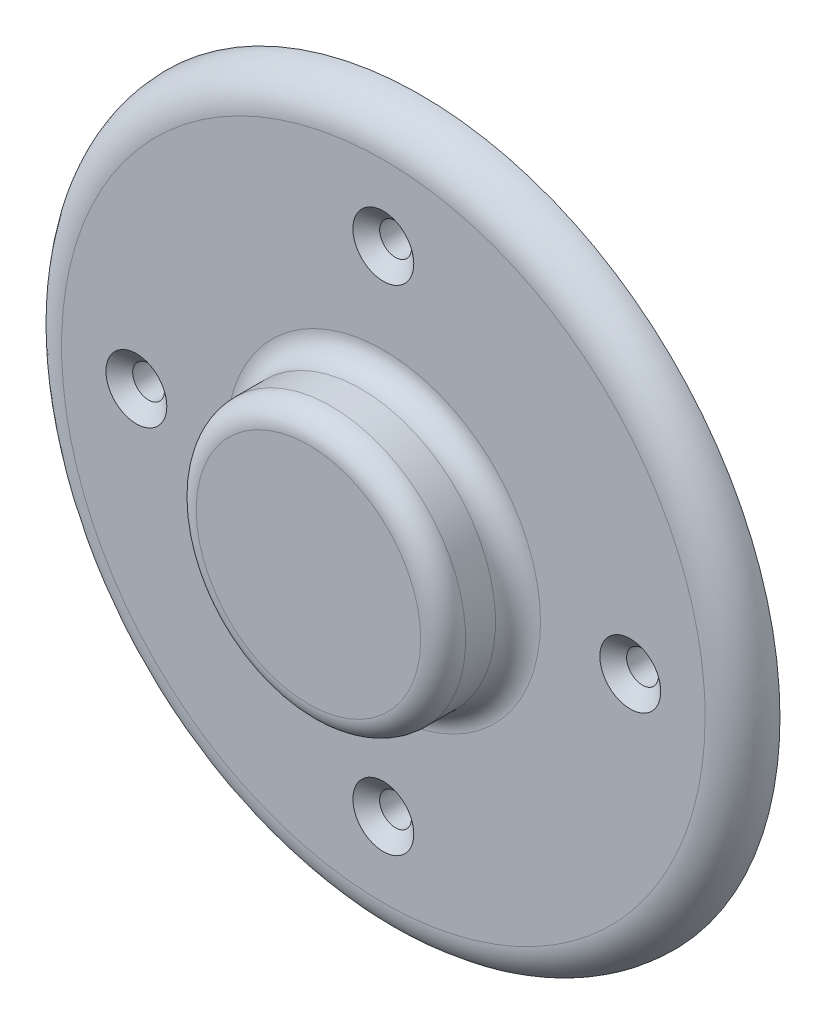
ISO-10303-21;
HEADER;
FILE_DESCRIPTION(('STEP AP214'),'2;1');
FILE_NAME('part.step','',(''),(''),'','','');
FILE_SCHEMA(('AUTOMOTIVE_DESIGN { 1 0 10303 214 1 1 1 1 }'));
ENDSEC;
DATA;
#1=APPLICATION_CONTEXT('core data for automotive mechanical design processes');
#2=APPLICATION_PROTOCOL_DEFINITION('international standard','automotive_design',2000,#1);
#3=PRODUCT_CONTEXT('',#1,'mechanical');
#4=PRODUCT('Part','Part','',(#3));
#5=PRODUCT_RELATED_PRODUCT_CATEGORY('part','',(#4));
#6=PRODUCT_DEFINITION_FORMATION('','',#4);
#7=PRODUCT_DEFINITION_CONTEXT('part definition',#1,'design');
#8=PRODUCT_DEFINITION('design','',#6,#7);
#9=PRODUCT_DEFINITION_SHAPE('','',#8);
#10=(LENGTH_UNIT() NAMED_UNIT(*) SI_UNIT(.MILLI.,.METRE.));
#11=(NAMED_UNIT(*) PLANE_ANGLE_UNIT() SI_UNIT($,.RADIAN.));
#12=(NAMED_UNIT(*) SI_UNIT($,.STERADIAN.) SOLID_ANGLE_UNIT());
#13=UNCERTAINTY_MEASURE_WITH_UNIT(LENGTH_MEASURE(1.E-05),#10,'distance_accuracy_value','');
#14=(GEOMETRIC_REPRESENTATION_CONTEXT(3) GLOBAL_UNCERTAINTY_ASSIGNED_CONTEXT((#13)) GLOBAL_UNIT_ASSIGNED_CONTEXT((#10,
#11,#12)) REPRESENTATION_CONTEXT('',''));
#15=CARTESIAN_POINT('',(0.,0.,0.));
#16=DIRECTION('',(0.,0.,1.));
#17=DIRECTION('',(1.,0.,0.));
#18=AXIS2_PLACEMENT_3D('',#15,#16,#17);
#19=CARTESIAN_POINT('',(136.525,0.,-31.75));
#20=CARTESIAN_POINT('',(136.525,8.93554035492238,-31.75));
#21=CARTESIAN_POINT('',(135.644947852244,17.8708597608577,-31.75));
#22=CARTESIAN_POINT('',(132.158472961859,35.398552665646,-31.75));
#23=CARTESIAN_POINT('',(129.55213642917,43.9904927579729,-31.75));
#24=CARTESIAN_POINT('',(122.713169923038,60.5012184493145,-31.75));
#25=CARTESIAN_POINT('',(118.4807090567,68.4195957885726,-31.75));
#26=CARTESIAN_POINT('',(108.55206858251,83.2788563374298,-31.75));
#27=CARTESIAN_POINT('',(102.856134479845,90.2193721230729,-31.75));
#28=CARTESIAN_POINT('',(90.2193721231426,102.856134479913,-31.75));
#29=CARTESIAN_POINT('',(83.2788563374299,108.552068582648,-31.75));
#30=CARTESIAN_POINT('',(68.4195957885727,118.480709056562,-31.75));
#31=CARTESIAN_POINT('',(60.5012184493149,122.713169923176,-31.75));
#32=CARTESIAN_POINT('',(43.9904927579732,129.552136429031,-31.75));
#33=CARTESIAN_POINT('',(35.3985526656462,132.158472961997,-31.75));
#34=CARTESIAN_POINT('',(17.870859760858,135.644947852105,-31.75));
#35=CARTESIAN_POINT('',(8.93554035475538,136.525,-31.75));
#36=CARTESIAN_POINT('',(-8.93554035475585,136.525,-31.75));
#37=CARTESIAN_POINT('',(-17.8708597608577,135.644947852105,-31.75));
#38=CARTESIAN_POINT('',(-35.3985526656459,132.158472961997,-31.75));
#39=CARTESIAN_POINT('',(-43.9904927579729,129.55213642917,-31.75));
#40=CARTESIAN_POINT('',(-60.5012184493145,122.713169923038,-31.75));
#41=CARTESIAN_POINT('',(-68.4195957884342,118.480709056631,-31.75));
#42=CARTESIAN_POINT('',(-83.2788563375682,108.552068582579,-31.75));
#43=CARTESIAN_POINT('',(-90.2193721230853,102.856134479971,-31.75));
#44=CARTESIAN_POINT('',(-102.856134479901,90.2193721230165,-31.75));
#45=CARTESIAN_POINT('',(-108.552068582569,83.2788563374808,-31.75));
#46=CARTESIAN_POINT('',(-118.480709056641,68.4195957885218,-31.75));
#47=CARTESIAN_POINT('',(-122.713169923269,60.5012184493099,-31.75));
#48=CARTESIAN_POINT('',(-129.552136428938,43.9904927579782,-31.75));
#49=CARTESIAN_POINT('',(-132.158472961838,35.3985526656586,-31.75));
#50=CARTESIAN_POINT('',(-135.644947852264,17.8708597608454,-31.75));
#51=CARTESIAN_POINT('',(-136.525,8.93554035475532,-31.75));
#52=CARTESIAN_POINT('',(-136.525,-8.9355403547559,-31.75));
#53=CARTESIAN_POINT('',(-135.644947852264,-17.8708597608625,-31.75));
#54=CARTESIAN_POINT('',(-132.158472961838,-35.3985526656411,-31.75));
#55=CARTESIAN_POINT('',(-129.552136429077,-43.9904927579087,-31.75));
#56=CARTESIAN_POINT('',(-122.713169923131,-60.5012184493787,-31.75));
#57=CARTESIAN_POINT('',(-118.480709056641,-68.4195957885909,-31.75));
#58=CARTESIAN_POINT('',(-108.552068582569,-83.2788563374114,-31.75));
#59=CARTESIAN_POINT('',(-102.856134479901,-90.2193721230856,-31.75));
#60=CARTESIAN_POINT('',(-90.2193721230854,-102.856134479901,-31.75));
#61=CARTESIAN_POINT('',(-83.2788563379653,-108.552068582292,-31.75));
#62=CARTESIAN_POINT('',(-68.4195957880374,-118.480709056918,-31.75));
#63=CARTESIAN_POINT('',(-60.5012184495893,-122.713169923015,-31.75));
#64=CARTESIAN_POINT('',(-43.9904927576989,-129.552136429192,-31.75));
#65=CARTESIAN_POINT('',(-35.3985526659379,-132.158472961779,-31.75));
#66=CARTESIAN_POINT('',(-17.8708597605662,-135.644947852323,-31.75));
#67=CARTESIAN_POINT('',(-8.93554035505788,-136.525,-31.75));
#68=CARTESIAN_POINT('',(8.93554035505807,-136.525,-31.75));
#69=CARTESIAN_POINT('',(17.870859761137,-135.644947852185,-31.75));
#70=CARTESIAN_POINT('',(35.3985526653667,-132.158472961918,-31.75));
#71=CARTESIAN_POINT('',(43.9904927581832,-129.552136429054,-31.75));
#72=CARTESIAN_POINT('',(60.5012184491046,-122.713169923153,-31.75));
#73=CARTESIAN_POINT('',(68.419595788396,-118.480709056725,-31.75));
#74=CARTESIAN_POINT('',(83.2788563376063,-108.552068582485,-31.75));
#75=CARTESIAN_POINT('',(90.2193721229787,-102.856134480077,-31.75));
#76=CARTESIAN_POINT('',(102.856134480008,-90.2193721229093,-31.75));
#77=CARTESIAN_POINT('',(108.5520685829,-83.2788563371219,-31.75));
#78=CARTESIAN_POINT('',(118.48070905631,-68.4195957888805,-31.75));
#79=CARTESIAN_POINT('',(122.713169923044,-60.5012184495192,-31.75));
#80=CARTESIAN_POINT('',(129.552136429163,-43.9904927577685,-31.75));
#81=CARTESIAN_POINT('',(132.158472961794,-35.3985526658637,-31.75));
#82=CARTESIAN_POINT('',(135.644947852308,-17.8708597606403,-31.75));
#83=CARTESIAN_POINT('',(136.525,-8.93554035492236,-31.75));
#84=CARTESIAN_POINT('',(136.525,0.,-31.75));
#85=CARTESIAN_POINT('',(152.4,0.,-31.75));
#86=CARTESIAN_POINT('',(152.4,9.97455667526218,-31.75));
#87=CARTESIAN_POINT('',(151.417616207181,19.9488667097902,-31.75));
#88=CARTESIAN_POINT('',(147.525737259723,39.5146634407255,-31.75));
#89=CARTESIAN_POINT('',(144.616338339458,49.105666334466,-31.75));
#90=CARTESIAN_POINT('',(136.982143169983,67.5362438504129,-31.75));
#91=CARTESIAN_POINT('',(132.257535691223,76.3753627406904,-31.75));
#92=CARTESIAN_POINT('',(121.174402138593,92.9624442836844,-31.75));
#93=CARTESIAN_POINT('',(114.816150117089,100.709996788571,-31.75));
#94=CARTESIAN_POINT('',(100.709996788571,114.816150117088,-31.75));
#95=CARTESIAN_POINT('',(92.9624442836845,121.174402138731,-31.75));
#96=CARTESIAN_POINT('',(76.3753627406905,132.257535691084,-31.75));
#97=CARTESIAN_POINT('',(67.5362438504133,136.982143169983,-31.75));
#98=CARTESIAN_POINT('',(49.1056663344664,144.616338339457,-31.75));
#99=CARTESIAN_POINT('',(39.5146634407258,147.525737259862,-31.75));
#100=CARTESIAN_POINT('',(19.9488667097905,151.417616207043,-31.75));
#101=CARTESIAN_POINT('',(9.97455667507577,152.4,-31.75));
#102=CARTESIAN_POINT('',(-9.97455667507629,152.4,-31.75));
#103=CARTESIAN_POINT('',(-19.9488667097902,151.417616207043,-31.75));
#104=CARTESIAN_POINT('',(-39.5146634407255,147.525737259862,-31.75));
#105=CARTESIAN_POINT('',(-49.105666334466,144.616338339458,-31.75));
#106=CARTESIAN_POINT('',(-67.5362438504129,136.982143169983,-31.75));
#107=CARTESIAN_POINT('',(-76.3753627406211,132.257535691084,-31.75));
#108=CARTESIAN_POINT('',(-92.9624442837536,121.174402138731,-31.75));
#109=CARTESIAN_POINT('',(-100.709996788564,114.816150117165,-31.75));
#110=CARTESIAN_POINT('',(-114.816150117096,100.709996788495,-31.75));
#111=CARTESIAN_POINT('',(-121.174402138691,92.9624442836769,-31.75));
#112=CARTESIAN_POINT('',(-132.257535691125,76.3753627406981,-31.75));
#113=CARTESIAN_POINT('',(-136.982143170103,67.5362438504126,-31.75));
#114=CARTESIAN_POINT('',(-144.616338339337,49.1056663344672,-31.75));
#115=CARTESIAN_POINT('',(-147.525737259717,39.5146634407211,-31.75));
#116=CARTESIAN_POINT('',(-151.417616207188,19.948866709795,-31.75));
#117=CARTESIAN_POINT('',(-152.4,9.97455667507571,-31.75));
#118=CARTESIAN_POINT('',(-152.4,-9.97455667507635,-31.75));
#119=CARTESIAN_POINT('',(-151.417616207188,-19.9488667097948,-31.75));
#120=CARTESIAN_POINT('',(-147.525737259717,-39.5146634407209,-31.75));
#121=CARTESIAN_POINT('',(-144.616338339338,-49.1056663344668,-31.75));
#122=CARTESIAN_POINT('',(-136.982143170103,-67.5362438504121,-31.75));
#123=CARTESIAN_POINT('',(-132.257535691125,-76.3753627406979,-31.75));
#124=CARTESIAN_POINT('',(-121.174402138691,-92.9624442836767,-31.75));
#125=CARTESIAN_POINT('',(-114.816150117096,-100.709996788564,-31.75));
#126=CARTESIAN_POINT('',(-100.709996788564,-114.816150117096,-31.75));
#127=CARTESIAN_POINT('',(-92.9624442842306,-121.174402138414,-31.75));
#128=CARTESIAN_POINT('',(-76.3753627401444,-132.257535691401,-31.75));
#129=CARTESIAN_POINT('',(-67.5362438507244,-136.982143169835,-31.75));
#130=CARTESIAN_POINT('',(-49.1056663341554,-144.616338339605,-31.75));
#131=CARTESIAN_POINT('',(-39.5146634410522,-147.525737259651,-31.75));
#132=CARTESIAN_POINT('',(-19.9488667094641,-151.417616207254,-31.75));
#133=CARTESIAN_POINT('',(-9.97455667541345,-152.4,-31.75));
#134=CARTESIAN_POINT('',(9.97455667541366,-152.4,-31.75));
#135=CARTESIAN_POINT('',(19.9488667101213,-151.417616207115,-31.75));
#136=CARTESIAN_POINT('',(39.5146634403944,-147.525737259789,-31.75));
#137=CARTESIAN_POINT('',(49.1056663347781,-144.616338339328,-31.75));
#138=CARTESIAN_POINT('',(67.5362438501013,-136.982143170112,-31.75));
#139=CARTESIAN_POINT('',(76.3753627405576,-132.257535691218,-31.75));
#140=CARTESIAN_POINT('',(92.9624442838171,-121.174402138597,-31.75));
#141=CARTESIAN_POINT('',(100.709996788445,-114.816150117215,-31.75));
#142=CARTESIAN_POINT('',(114.816150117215,-100.709996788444,-31.75));
#143=CARTESIAN_POINT('',(121.174402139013,-92.9624442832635,-31.75));
#144=CARTESIAN_POINT('',(132.257535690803,-76.3753627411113,-31.75));
#145=CARTESIAN_POINT('',(136.982143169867,-67.5362438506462,-31.75));
#146=CARTESIAN_POINT('',(144.616338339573,-49.1056663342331,-31.75));
#147=CARTESIAN_POINT('',(147.525737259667,-39.5146634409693,-31.75));
#148=CARTESIAN_POINT('',(151.417616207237,-19.9488667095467,-31.75));
#149=CARTESIAN_POINT('',(152.4,-9.97455667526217,-31.75));
#150=CARTESIAN_POINT('',(152.4,0.,-31.75));
#151=CARTESIAN_POINT('',(152.4,0.,-47.625));
#152=CARTESIAN_POINT('',(152.4,9.97455667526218,-47.625));
#153=CARTESIAN_POINT('',(151.417616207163,19.9488667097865,-47.625));
#154=CARTESIAN_POINT('',(147.525737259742,39.5146634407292,-47.625));
#155=CARTESIAN_POINT('',(144.616338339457,49.1056663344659,-47.625));
#156=CARTESIAN_POINT('',(136.982143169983,67.5362438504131,-47.625));
#157=CARTESIAN_POINT('',(132.257535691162,76.3753627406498,-47.625));
#158=CARTESIAN_POINT('',(121.174402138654,92.962444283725,-47.625));
#159=CARTESIAN_POINT('',(114.816150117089,100.709996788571,-47.625));
#160=CARTESIAN_POINT('',(100.709996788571,114.816150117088,-47.625));
#161=CARTESIAN_POINT('',(92.9624442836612,121.174402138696,-47.625));
#162=CARTESIAN_POINT('',(76.3753627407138,132.257535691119,-47.625));
#163=CARTESIAN_POINT('',(67.5362438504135,136.982143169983,-47.625));
#164=CARTESIAN_POINT('',(49.1056663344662,144.616338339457,-47.625));
#165=CARTESIAN_POINT('',(39.5146634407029,147.525737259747,-47.625));
#166=CARTESIAN_POINT('',(19.9488667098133,151.417616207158,-47.625));
#167=CARTESIAN_POINT('',(9.97455667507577,152.4,-47.625));
#168=CARTESIAN_POINT('',(-9.97455667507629,152.4,-47.625));
#169=CARTESIAN_POINT('',(-19.948866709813,151.417616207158,-47.625));
#170=CARTESIAN_POINT('',(-39.5146634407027,147.525737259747,-47.625));
#171=CARTESIAN_POINT('',(-49.1056663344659,144.616338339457,-47.625));
#172=CARTESIAN_POINT('',(-67.5362438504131,136.982143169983,-47.625));
#173=CARTESIAN_POINT('',(-76.3753627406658,132.257535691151,-47.625));
#174=CARTESIAN_POINT('',(-92.9624442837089,121.174402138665,-47.625));
#175=CARTESIAN_POINT('',(-100.709996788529,114.816150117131,-47.625));
#176=CARTESIAN_POINT('',(-114.81615011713,100.709996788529,-47.625));
#177=CARTESIAN_POINT('',(-121.174402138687,92.9624442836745,-47.625));
#178=CARTESIAN_POINT('',(-132.257535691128,76.3753627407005,-47.625));
#179=CARTESIAN_POINT('',(-136.982143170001,67.5362438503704,-47.625));
#180=CARTESIAN_POINT('',(-144.616338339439,49.1056663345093,-47.625));
#181=CARTESIAN_POINT('',(-147.525737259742,39.5146634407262,-47.625));
#182=CARTESIAN_POINT('',(-151.417616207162,19.9488667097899,-47.625));
#183=CARTESIAN_POINT('',(-152.4,9.97455667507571,-47.625));
#184=CARTESIAN_POINT('',(-152.4,-9.97455667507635,-47.625));
#185=CARTESIAN_POINT('',(-151.417616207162,-19.9488667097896,-47.625));
#186=CARTESIAN_POINT('',(-147.525737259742,-39.514663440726,-47.625));
#187=CARTESIAN_POINT('',(-144.616338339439,-49.1056663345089,-47.625));
#188=CARTESIAN_POINT('',(-136.982143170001,-67.53624385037,-47.625));
#189=CARTESIAN_POINT('',(-132.257535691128,-76.3753627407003,-47.625));
#190=CARTESIAN_POINT('',(-121.174402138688,-92.9624442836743,-47.625));
#191=CARTESIAN_POINT('',(-114.816150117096,-100.709996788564,-47.625));
#192=CARTESIAN_POINT('',(-100.709996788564,-114.816150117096,-47.625));
#193=CARTESIAN_POINT('',(-92.9624442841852,-121.174402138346,-47.625));
#194=CARTESIAN_POINT('',(-76.3753627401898,-132.257535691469,-47.625));
#195=CARTESIAN_POINT('',(-67.5362438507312,-136.982143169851,-47.625));
#196=CARTESIAN_POINT('',(-49.1056663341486,-144.616338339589,-47.625));
#197=CARTESIAN_POINT('',(-39.5146634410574,-147.525737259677,-47.625));
#198=CARTESIAN_POINT('',(-19.9488667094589,-151.417616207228,-47.625));
#199=CARTESIAN_POINT('',(-9.97455667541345,-152.4,-47.625));
#200=CARTESIAN_POINT('',(9.97455667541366,-152.4,-47.625));
#201=CARTESIAN_POINT('',(19.9488667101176,-151.417616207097,-47.625));
#202=CARTESIAN_POINT('',(39.5146634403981,-147.525737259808,-47.625));
#203=CARTESIAN_POINT('',(49.105666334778,-144.616338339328,-47.625));
#204=CARTESIAN_POINT('',(67.5362438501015,-136.982143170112,-47.625));
#205=CARTESIAN_POINT('',(76.37536274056,-132.257535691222,-47.625));
#206=CARTESIAN_POINT('',(92.9624442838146,-121.174402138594,-47.625));
#207=CARTESIAN_POINT('',(100.709996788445,-114.816150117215,-47.625));
#208=CARTESIAN_POINT('',(114.816150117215,-100.709996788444,-47.625));
#209=CARTESIAN_POINT('',(121.174402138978,-92.9624442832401,-47.625));
#210=CARTESIAN_POINT('',(132.257535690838,-76.3753627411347,-47.625));
#211=CARTESIAN_POINT('',(136.982143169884,-67.5362438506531,-47.625));
#212=CARTESIAN_POINT('',(144.616338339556,-49.1056663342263,-47.625));
#213=CARTESIAN_POINT('',(147.525737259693,-39.5146634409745,-47.625));
#214=CARTESIAN_POINT('',(151.417616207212,-19.9488667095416,-47.625));
#215=CARTESIAN_POINT('',(152.4,-9.97455667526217,-47.625));
#216=CARTESIAN_POINT('',(152.4,0.,-47.625));
#217=(BOUNDED_SURFACE() B_SPLINE_SURFACE(2,3,((#19,#20,#21,#22,#23,#24,#25,#26,#27,#28,#29,#30,
#31,#32,#33,#34,#35,#36,#37,#38,#39,#40,#41,#42,#43,#44,#45,#46,#47,#48,#49,#50,#51,#52,#53,#54,
#55,#56,#57,#58,#59,#60,#61,#62,#63,#64,#65,#66,#67,#68,#69,#70,#71,#72,#73,#74,#75,#76,#77,#78,
#79,#80,#81,#82,#83,#84),(#85,#86,#87,#88,#89,#90,#91,#92,#93,#94,#95,#96,#97,#98,#99,#100,#101,
#102,#103,#104,#105,#106,#107,#108,#109,#110,#111,#112,#113,#114,#115,#116,#117,#118,#119,#120,
#121,#122,#123,#124,#125,#126,#127,#128,#129,#130,#131,#132,#133,#134,#135,#136,#137,#138,#139,
#140,#141,#142,#143,#144,#145,#146,#147,#148,#149,#150),(#151,#152,#153,#154,#155,#156,#157,
#158,#159,#160,#161,#162,#163,#164,#165,#166,#167,#168,#169,#170,#171,#172,#173,#174,#175,#176,
#177,#178,#179,#180,#181,#182,#183,#184,#185,#186,#187,#188,#189,#190,#191,#192,#193,#194,#195,
#196,#197,#198,#199,#200,#201,#202,#203,#204,#205,#206,#207,#208,#209,#210,#211,#212,#213,#214,
#215,#216)),.UNSPECIFIED.,.F.,.T.,.F.) B_SPLINE_SURFACE_WITH_KNOTS((3,3),(4,2,2,2,2,2,2,2,2,2,2,
2,2,2,2,2,2,2,2,2,2,2,2,2,2,2,2,2,2,2,2,2,4),(0.,1.),(-6.28318530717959,-6.08683576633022,
-5.89048622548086,-5.6941366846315,-5.49778714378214,-5.30143760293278,-5.10508806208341,
-4.90873852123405,-4.71238898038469,-4.51603943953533,-4.31968989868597,-4.1233403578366,
-3.92699081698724,-3.73064127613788,-3.53429173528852,-3.33794219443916,-3.14159265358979,
-2.94524311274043,-2.74889357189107,-2.55254403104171,-2.35619449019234,-2.15984494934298,
-1.96349540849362,-1.76714586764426,-1.5707963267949,-1.37444678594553,-1.17809724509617,
-0.98174770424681,-0.785398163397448,-0.589048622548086,-0.392699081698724,-0.196349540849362,
0.),.UNSPECIFIED.) GEOMETRIC_REPRESENTATION_ITEM() RATIONAL_B_SPLINE_SURFACE(((1.,1.,1.,1.,1.,
1.,1.,1.,1.,1.,1.,1.,1.,1.,1.,1.,1.,1.,1.,1.,1.,1.,1.,1.,1.,1.,1.,1.,1.,1.,1.,1.,1.,1.,1.,1.,1.,
1.,1.,1.,1.,1.,1.,1.,1.,1.,1.,1.,1.,1.,1.,1.,1.,1.,1.,1.,1.,1.,1.,1.,1.,1.,1.,1.,1.,1.),
(0.707106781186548,0.707106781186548,0.707106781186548,0.707106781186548,0.707106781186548,
0.707106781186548,0.707106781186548,0.707106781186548,0.707106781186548,0.707106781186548,
0.707106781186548,0.707106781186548,0.707106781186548,0.707106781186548,0.707106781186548,
0.707106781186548,0.707106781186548,0.707106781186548,0.707106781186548,0.707106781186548,
0.707106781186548,0.707106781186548,0.707106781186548,0.707106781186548,0.707106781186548,
0.707106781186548,0.707106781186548,0.707106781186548,0.707106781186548,0.707106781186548,
0.707106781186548,0.707106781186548,0.707106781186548,0.707106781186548,0.707106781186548,
0.707106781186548,0.707106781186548,0.707106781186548,0.707106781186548,0.707106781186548,
0.707106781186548,0.707106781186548,0.707106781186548,0.707106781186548,0.707106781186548,
0.707106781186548,0.707106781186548,0.707106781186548,0.707106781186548,0.707106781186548,
0.707106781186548,0.707106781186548,0.707106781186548,0.707106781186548,0.707106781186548,
0.707106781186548,0.707106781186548,0.707106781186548,0.707106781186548,0.707106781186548,
0.707106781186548,0.707106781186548,0.707106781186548,0.707106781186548,0.707106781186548,
0.707106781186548),(1.,1.,1.,1.,1.,1.,1.,1.,1.,1.,1.,1.,1.,1.,1.,1.,1.,1.,1.,1.,1.,1.,1.,1.,1.,
1.,1.,1.,1.,1.,1.,1.,1.,1.,1.,1.,1.,1.,1.,1.,1.,1.,1.,1.,1.,1.,1.,1.,1.,1.,1.,1.,1.,1.,1.,1.,1.,
1.,1.,1.,1.,1.,1.,1.,1.,1.))) REPRESENTATION_ITEM('') SURFACE());
#218=CARTESIAN_POINT('',(136.525,0.,-31.75));
#219=CARTESIAN_POINT('',(136.525,-8.93554035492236,-31.75));
#220=CARTESIAN_POINT('',(135.644947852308,-17.8708597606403,-31.75));
#221=CARTESIAN_POINT('',(132.158472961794,-35.3985526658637,-31.75));
#222=CARTESIAN_POINT('',(129.552136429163,-43.9904927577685,-31.75));
#223=CARTESIAN_POINT('',(122.713169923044,-60.5012184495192,-31.75));
#224=CARTESIAN_POINT('',(118.48070905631,-68.4195957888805,-31.75));
#225=CARTESIAN_POINT('',(108.5520685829,-83.2788563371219,-31.75));
#226=CARTESIAN_POINT('',(102.856134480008,-90.2193721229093,-31.75));
#227=CARTESIAN_POINT('',(90.2193721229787,-102.856134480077,-31.75));
#228=CARTESIAN_POINT('',(83.2788563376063,-108.552068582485,-31.75));
#229=CARTESIAN_POINT('',(68.419595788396,-118.480709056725,-31.75));
#230=CARTESIAN_POINT('',(60.5012184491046,-122.713169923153,-31.75));
#231=CARTESIAN_POINT('',(43.9904927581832,-129.552136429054,-31.75));
#232=CARTESIAN_POINT('',(35.3985526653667,-132.158472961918,-31.75));
#233=CARTESIAN_POINT('',(17.870859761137,-135.644947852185,-31.75));
#234=CARTESIAN_POINT('',(8.93554035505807,-136.525,-31.75));
#235=CARTESIAN_POINT('',(-8.93554035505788,-136.525,-31.75));
#236=CARTESIAN_POINT('',(-17.8708597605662,-135.644947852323,-31.75));
#237=CARTESIAN_POINT('',(-35.3985526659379,-132.158472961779,-31.75));
#238=CARTESIAN_POINT('',(-43.9904927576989,-129.552136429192,-31.75));
#239=CARTESIAN_POINT('',(-60.5012184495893,-122.713169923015,-31.75));
#240=CARTESIAN_POINT('',(-68.4195957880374,-118.480709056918,-31.75));
#241=CARTESIAN_POINT('',(-83.2788563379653,-108.552068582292,-31.75));
#242=CARTESIAN_POINT('',(-90.2193721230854,-102.856134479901,-31.75));
#243=CARTESIAN_POINT('',(-102.856134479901,-90.2193721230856,-31.75));
#244=CARTESIAN_POINT('',(-108.552068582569,-83.2788563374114,-31.75));
#245=CARTESIAN_POINT('',(-118.480709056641,-68.4195957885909,-31.75));
#246=CARTESIAN_POINT('',(-122.713169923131,-60.5012184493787,-31.75));
#247=CARTESIAN_POINT('',(-129.552136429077,-43.9904927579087,-31.75));
#248=CARTESIAN_POINT('',(-132.158472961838,-35.3985526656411,-31.75));
#249=CARTESIAN_POINT('',(-135.644947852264,-17.8708597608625,-31.75));
#250=CARTESIAN_POINT('',(-136.525,-8.9355403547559,-31.75));
#251=CARTESIAN_POINT('',(-136.525,8.93554035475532,-31.75));
#252=CARTESIAN_POINT('',(-135.644947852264,17.8708597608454,-31.75));
#253=CARTESIAN_POINT('',(-132.158472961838,35.3985526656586,-31.75));
#254=CARTESIAN_POINT('',(-129.552136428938,43.9904927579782,-31.75));
#255=CARTESIAN_POINT('',(-122.713169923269,60.5012184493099,-31.75));
#256=CARTESIAN_POINT('',(-118.480709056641,68.4195957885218,-31.75));
#257=CARTESIAN_POINT('',(-108.552068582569,83.2788563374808,-31.75));
#258=CARTESIAN_POINT('',(-102.856134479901,90.2193721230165,-31.75));
#259=CARTESIAN_POINT('',(-90.2193721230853,102.856134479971,-31.75));
#260=CARTESIAN_POINT('',(-83.2788563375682,108.552068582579,-31.75));
#261=CARTESIAN_POINT('',(-68.4195957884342,118.480709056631,-31.75));
#262=CARTESIAN_POINT('',(-60.5012184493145,122.713169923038,-31.75));
#263=CARTESIAN_POINT('',(-43.9904927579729,129.55213642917,-31.75));
#264=CARTESIAN_POINT('',(-35.3985526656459,132.158472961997,-31.75));
#265=CARTESIAN_POINT('',(-17.8708597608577,135.644947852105,-31.75));
#266=CARTESIAN_POINT('',(-8.93554035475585,136.525,-31.75));
#267=CARTESIAN_POINT('',(8.93554035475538,136.525,-31.75));
#268=CARTESIAN_POINT('',(17.870859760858,135.644947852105,-31.75));
#269=CARTESIAN_POINT('',(35.3985526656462,132.158472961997,-31.75));
#270=CARTESIAN_POINT('',(43.9904927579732,129.552136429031,-31.75));
#271=CARTESIAN_POINT('',(60.5012184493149,122.713169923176,-31.75));
#272=CARTESIAN_POINT('',(68.4195957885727,118.480709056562,-31.75));
#273=CARTESIAN_POINT('',(83.2788563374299,108.552068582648,-31.75));
#274=CARTESIAN_POINT('',(90.2193721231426,102.856134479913,-31.75));
#275=CARTESIAN_POINT('',(102.856134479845,90.2193721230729,-31.75));
#276=CARTESIAN_POINT('',(108.55206858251,83.2788563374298,-31.75));
#277=CARTESIAN_POINT('',(118.4807090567,68.4195957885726,-31.75));
#278=CARTESIAN_POINT('',(122.713169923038,60.5012184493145,-31.75));
#279=CARTESIAN_POINT('',(129.55213642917,43.9904927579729,-31.75));
#280=CARTESIAN_POINT('',(132.158472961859,35.398552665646,-31.75));
#281=CARTESIAN_POINT('',(135.644947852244,17.8708597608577,-31.75));
#282=CARTESIAN_POINT('',(136.525,8.93554035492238,-31.75));
#283=CARTESIAN_POINT('',(136.525,0.,-31.75));
#284=(BOUNDED_CURVE() B_SPLINE_CURVE(3,(#218,#219,#220,#221,#222,#223,#224,#225,#226,#227,#228,
#229,#230,#231,#232,#233,#234,#235,#236,#237,#238,#239,#240,#241,#242,#243,#244,#245,#246,#247,
#248,#249,#250,#251,#252,#253,#254,#255,#256,#257,#258,#259,#260,#261,#262,#263,#264,#265,#266,
#267,#268,#269,#270,#271,#272,#273,#274,#275,#276,#277,#278,#279,#280,#281,#282,#283),
.UNSPECIFIED.,.T.,.F.) B_SPLINE_CURVE_WITH_KNOTS((4,2,2,2,2,2,2,2,2,2,2,2,2,2,2,2,2,2,2,2,2,2,2,
2,2,2,2,2,2,2,2,2,4),(-6.28318530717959,-6.08683576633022,-5.89048622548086,-5.6941366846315,
-5.49778714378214,-5.30143760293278,-5.10508806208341,-4.90873852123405,-4.71238898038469,
-4.51603943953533,-4.31968989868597,-4.1233403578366,-3.92699081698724,-3.73064127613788,
-3.53429173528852,-3.33794219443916,-3.14159265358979,-2.94524311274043,-2.74889357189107,
-2.55254403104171,-2.35619449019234,-2.15984494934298,-1.96349540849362,-1.76714586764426,
-1.5707963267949,-1.37444678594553,-1.17809724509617,-0.981747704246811,-0.785398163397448,
-0.589048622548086,-0.392699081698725,-0.196349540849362,0.),
.UNSPECIFIED.) CURVE() GEOMETRIC_REPRESENTATION_ITEM() RATIONAL_B_SPLINE_CURVE((1.,1.,1.,1.,1.,
1.,1.,1.,1.,1.,1.,1.,1.,1.,1.,1.,1.,1.,1.,1.,1.,1.,1.,1.,1.,1.,1.,1.,1.,1.,1.,1.,1.,1.,1.,1.,1.,
1.,1.,1.,1.,1.,1.,1.,1.,1.,1.,1.,1.,1.,1.,1.,1.,1.,1.,1.,1.,1.,1.,1.,1.,1.,1.,1.,1.,1.)) REPRESENTATION_ITEM(''));
#285=CARTESIAN_POINT('',(136.525,0.,-31.75));
#286=VERTEX_POINT('',#285);
#287=EDGE_CURVE('E10',#286,#286,#284,.F.);
#288=CARTESIAN_POINT('',(152.4,0.,-47.625));
#289=CARTESIAN_POINT('',(152.4,9.97455667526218,-47.625));
#290=CARTESIAN_POINT('',(151.417616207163,19.9488667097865,-47.625));
#291=CARTESIAN_POINT('',(147.525737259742,39.5146634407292,-47.625));
#292=CARTESIAN_POINT('',(144.616338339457,49.1056663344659,-47.625));
#293=CARTESIAN_POINT('',(136.982143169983,67.5362438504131,-47.625));
#294=CARTESIAN_POINT('',(132.257535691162,76.3753627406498,-47.625));
#295=CARTESIAN_POINT('',(121.174402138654,92.962444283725,-47.625));
#296=CARTESIAN_POINT('',(114.816150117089,100.709996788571,-47.625));
#297=CARTESIAN_POINT('',(100.709996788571,114.816150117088,-47.625));
#298=CARTESIAN_POINT('',(92.9624442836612,121.174402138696,-47.625));
#299=CARTESIAN_POINT('',(76.3753627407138,132.257535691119,-47.625));
#300=CARTESIAN_POINT('',(67.5362438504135,136.982143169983,-47.625));
#301=CARTESIAN_POINT('',(49.1056663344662,144.616338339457,-47.625));
#302=CARTESIAN_POINT('',(39.5146634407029,147.525737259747,-47.625));
#303=CARTESIAN_POINT('',(19.9488667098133,151.417616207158,-47.625));
#304=CARTESIAN_POINT('',(9.97455667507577,152.4,-47.625));
#305=CARTESIAN_POINT('',(-9.97455667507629,152.4,-47.625));
#306=CARTESIAN_POINT('',(-19.948866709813,151.417616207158,-47.625));
#307=CARTESIAN_POINT('',(-39.5146634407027,147.525737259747,-47.625));
#308=CARTESIAN_POINT('',(-49.1056663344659,144.616338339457,-47.625));
#309=CARTESIAN_POINT('',(-67.5362438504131,136.982143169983,-47.625));
#310=CARTESIAN_POINT('',(-76.3753627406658,132.257535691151,-47.625));
#311=CARTESIAN_POINT('',(-92.9624442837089,121.174402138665,-47.625));
#312=CARTESIAN_POINT('',(-100.709996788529,114.816150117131,-47.625));
#313=CARTESIAN_POINT('',(-114.81615011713,100.709996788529,-47.625));
#314=CARTESIAN_POINT('',(-121.174402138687,92.9624442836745,-47.625));
#315=CARTESIAN_POINT('',(-132.257535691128,76.3753627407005,-47.625));
#316=CARTESIAN_POINT('',(-136.982143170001,67.5362438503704,-47.625));
#317=CARTESIAN_POINT('',(-144.616338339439,49.1056663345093,-47.625));
#318=CARTESIAN_POINT('',(-147.525737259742,39.5146634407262,-47.625));
#319=CARTESIAN_POINT('',(-151.417616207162,19.9488667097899,-47.625));
#320=CARTESIAN_POINT('',(-152.4,9.97455667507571,-47.625));
#321=CARTESIAN_POINT('',(-152.4,-9.97455667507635,-47.625));
#322=CARTESIAN_POINT('',(-151.417616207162,-19.9488667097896,-47.625));
#323=CARTESIAN_POINT('',(-147.525737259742,-39.514663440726,-47.625));
#324=CARTESIAN_POINT('',(-144.616338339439,-49.1056663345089,-47.625));
#325=CARTESIAN_POINT('',(-136.982143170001,-67.53624385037,-47.625));
#326=CARTESIAN_POINT('',(-132.257535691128,-76.3753627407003,-47.625));
#327=CARTESIAN_POINT('',(-121.174402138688,-92.9624442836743,-47.625));
#328=CARTESIAN_POINT('',(-114.816150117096,-100.709996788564,-47.625));
#329=CARTESIAN_POINT('',(-100.709996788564,-114.816150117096,-47.625));
#330=CARTESIAN_POINT('',(-92.9624442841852,-121.174402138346,-47.625));
#331=CARTESIAN_POINT('',(-76.3753627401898,-132.257535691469,-47.625));
#332=CARTESIAN_POINT('',(-67.5362438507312,-136.982143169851,-47.625));
#333=CARTESIAN_POINT('',(-49.1056663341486,-144.616338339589,-47.625));
#334=CARTESIAN_POINT('',(-39.5146634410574,-147.525737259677,-47.625));
#335=CARTESIAN_POINT('',(-19.9488667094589,-151.417616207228,-47.625));
#336=CARTESIAN_POINT('',(-9.97455667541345,-152.4,-47.625));
#337=CARTESIAN_POINT('',(9.97455667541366,-152.4,-47.625));
#338=CARTESIAN_POINT('',(19.9488667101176,-151.417616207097,-47.625));
#339=CARTESIAN_POINT('',(39.5146634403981,-147.525737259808,-47.625));
#340=CARTESIAN_POINT('',(49.105666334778,-144.616338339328,-47.625));
#341=CARTESIAN_POINT('',(67.5362438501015,-136.982143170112,-47.625));
#342=CARTESIAN_POINT('',(76.37536274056,-132.257535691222,-47.625));
#343=CARTESIAN_POINT('',(92.9624442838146,-121.174402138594,-47.625));
#344=CARTESIAN_POINT('',(100.709996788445,-114.816150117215,-47.625));
#345=CARTESIAN_POINT('',(114.816150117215,-100.709996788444,-47.625));
#346=CARTESIAN_POINT('',(121.174402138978,-92.9624442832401,-47.625));
#347=CARTESIAN_POINT('',(132.257535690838,-76.3753627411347,-47.625));
#348=CARTESIAN_POINT('',(136.982143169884,-67.5362438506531,-47.625));
#349=CARTESIAN_POINT('',(144.616338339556,-49.1056663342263,-47.625));
#350=CARTESIAN_POINT('',(147.525737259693,-39.5146634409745,-47.625));
#351=CARTESIAN_POINT('',(151.417616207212,-19.9488667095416,-47.625));
#352=CARTESIAN_POINT('',(152.4,-9.97455667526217,-47.625));
#353=CARTESIAN_POINT('',(152.4,0.,-47.625));
#354=(BOUNDED_CURVE() B_SPLINE_CURVE(3,(#288,#289,#290,#291,#292,#293,#294,#295,#296,#297,#298,
#299,#300,#301,#302,#303,#304,#305,#306,#307,#308,#309,#310,#311,#312,#313,#314,#315,#316,#317,
#318,#319,#320,#321,#322,#323,#324,#325,#326,#327,#328,#329,#330,#331,#332,#333,#334,#335,#336,
#337,#338,#339,#340,#341,#342,#343,#344,#345,#346,#347,#348,#349,#350,#351,#352,#353),
.UNSPECIFIED.,.T.,.F.) B_SPLINE_CURVE_WITH_KNOTS((4,2,2,2,2,2,2,2,2,2,2,2,2,2,2,2,2,2,2,2,2,2,2,
2,2,2,2,2,2,2,2,2,4),(-6.28318530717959,-6.08683576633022,-5.89048622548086,-5.6941366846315,
-5.49778714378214,-5.30143760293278,-5.10508806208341,-4.90873852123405,-4.71238898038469,
-4.51603943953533,-4.31968989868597,-4.1233403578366,-3.92699081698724,-3.73064127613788,
-3.53429173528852,-3.33794219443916,-3.14159265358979,-2.94524311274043,-2.74889357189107,
-2.55254403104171,-2.35619449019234,-2.15984494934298,-1.96349540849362,-1.76714586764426,
-1.5707963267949,-1.37444678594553,-1.17809724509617,-0.98174770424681,-0.785398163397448,
-0.589048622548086,-0.392699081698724,-0.196349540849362,0.),
.UNSPECIFIED.) CURVE() GEOMETRIC_REPRESENTATION_ITEM() RATIONAL_B_SPLINE_CURVE((1.,1.,1.,1.,1.,
1.,1.,1.,1.,1.,1.,1.,1.,1.,1.,1.,1.,1.,1.,1.,1.,1.,1.,1.,1.,1.,1.,1.,1.,1.,1.,1.,1.,1.,1.,1.,1.,
1.,1.,1.,1.,1.,1.,1.,1.,1.,1.,1.,1.,1.,1.,1.,1.,1.,1.,1.,1.,1.,1.,1.,1.,1.,1.,1.,1.,1.)) REPRESENTATION_ITEM(''));
#355=CARTESIAN_POINT('',(152.4,0.,-47.625));
#356=VERTEX_POINT('',#355);
#357=EDGE_CURVE('E86',#356,#356,#354,.T.);
#358=ORIENTED_EDGE('',*,*,#287,.F.);
#359=EDGE_LOOP('',(#358));
#360=FACE_BOUND('',#359,.T.);
#361=ORIENTED_EDGE('',*,*,#357,.T.);
#362=EDGE_LOOP('',(#361));
#363=FACE_BOUND('',#362,.T.);
#364=ADVANCED_FACE('F26',(#360,#363),#217,.T.);
#365=CARTESIAN_POINT('',(0.,0.,0.));
#366=DIRECTION('',(0.,0.,-1.));
#367=DIRECTION('',(-1.,0.,0.));
#368=AXIS2_PLACEMENT_3D('',#365,#366,#367);
#369=PLANE('',#368);
#370=CARTESIAN_POINT('',(0.,0.,0.));
#371=DIRECTION('',(0.,0.,-1.));
#372=DIRECTION('',(-1.,0.,0.));
#373=AXIS2_PLACEMENT_3D('',#370,#371,#372);
#374=CIRCLE('',#373,47.625);
#375=CARTESIAN_POINT('',(-47.625,0.,0.));
#376=VERTEX_POINT('',#375);
#377=EDGE_CURVE('E38',#376,#376,#374,.F.);
#378=ORIENTED_EDGE('',*,*,#377,.T.);
#379=EDGE_LOOP('',(#378));
#380=FACE_BOUND('',#379,.T.);
#381=ADVANCED_FACE('F71',(#380),#369,.F.);
#382=CARTESIAN_POINT('',(0.,0.,0.));
#383=DIRECTION('',(0.,0.,1.));
#384=DIRECTION('',(1.,0.,0.));
#385=AXIS2_PLACEMENT_3D('',#382,#383,#384);
#386=CYLINDRICAL_SURFACE('',#385,57.15);
#387=CARTESIAN_POINT('',(0.,0.,-22.225));
#388=DIRECTION('',(0.,0.,-1.));
#389=DIRECTION('',(-1.,0.,0.));
#390=AXIS2_PLACEMENT_3D('',#387,#388,#389);
#391=CIRCLE('',#390,57.15);
#392=CARTESIAN_POINT('',(-57.15,0.,-22.225));
#393=VERTEX_POINT('',#392);
#394=EDGE_CURVE('E48',#393,#393,#391,.F.);
#395=ORIENTED_EDGE('',*,*,#394,.T.);
#396=EDGE_LOOP('',(#395));
#397=FACE_BOUND('',#396,.T.);
#398=CARTESIAN_POINT('',(0.,0.,-9.525));
#399=DIRECTION('',(0.,0.,-1.));
#400=DIRECTION('',(-1.,0.,0.));
#401=AXIS2_PLACEMENT_3D('',#398,#399,#400);
#402=CIRCLE('',#401,57.15);
#403=CARTESIAN_POINT('',(-57.15,0.,-9.525));
#404=VERTEX_POINT('',#403);
#405=EDGE_CURVE('E140',#404,#404,#402,.T.);
#406=ORIENTED_EDGE('',*,*,#405,.T.);
#407=EDGE_LOOP('',(#406));
#408=FACE_BOUND('',#407,.T.);
#409=ADVANCED_FACE('F67',(#397,#408),#386,.T.);
#410=CARTESIAN_POINT('',(-152.4,0.,-31.75));
#411=DIRECTION('',(0.,0.,-1.));
#412=DIRECTION('',(-1.,0.,0.));
#413=AXIS2_PLACEMENT_3D('',#410,#411,#412);
#414=PLANE('',#413);
#415=ORIENTED_EDGE('',*,*,#287,.T.);
#416=EDGE_LOOP('',(#415));
#417=FACE_BOUND('',#416,.T.);
#418=CARTESIAN_POINT('',(0.,0.,-31.75));
#419=DIRECTION('',(0.,0.,-1.));
#420=DIRECTION('',(-1.,0.,0.));
#421=AXIS2_PLACEMENT_3D('',#418,#419,#420);
#422=CIRCLE('',#421,66.675);
#423=CARTESIAN_POINT('',(-66.675,0.,-31.75));
#424=VERTEX_POINT('',#423);
#425=EDGE_CURVE('E43',#424,#424,#422,.T.);
#426=ORIENTED_EDGE('',*,*,#425,.T.);
#427=EDGE_LOOP('',(#426));
#428=FACE_BOUND('',#427,.T.);
#429=CARTESIAN_POINT('',(1.09746050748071E-12,104.775,-31.75));
#430=DIRECTION('',(0.,0.,1.));
#431=DIRECTION('',(1.,0.,0.));
#432=AXIS2_PLACEMENT_3D('',#429,#430,#431);
#433=CIRCLE('',#432,12.9159);
#434=CARTESIAN_POINT('',(12.9159000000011,104.775,-31.75));
#435=VERTEX_POINT('',#434);
#436=EDGE_CURVE('E136',#435,#435,#433,.T.);
#437=ORIENTED_EDGE('',*,*,#436,.F.);
#438=EDGE_LOOP('',(#437));
#439=FACE_BOUND('',#438,.T.);
#440=CARTESIAN_POINT('',(-104.775,7.31640338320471E-13,-31.75));
#441=DIRECTION('',(0.,0.,1.));
#442=DIRECTION('',(1.,0.,0.));
#443=AXIS2_PLACEMENT_3D('',#440,#441,#442);
#444=CIRCLE('',#443,12.9159);
#445=CARTESIAN_POINT('',(-91.8591,7.31640338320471E-13,-31.75));
#446=VERTEX_POINT('',#445);
#447=EDGE_CURVE('E132',#446,#446,#444,.T.);
#448=ORIENTED_EDGE('',*,*,#447,.F.);
#449=EDGE_LOOP('',(#448));
#450=FACE_BOUND('',#449,.T.);
#451=CARTESIAN_POINT('',(-3.65820169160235E-13,-104.775,-31.75));
#452=DIRECTION('',(0.,0.,1.));
#453=DIRECTION('',(1.,0.,0.));
#454=AXIS2_PLACEMENT_3D('',#451,#452,#453);
#455=CIRCLE('',#454,12.9159);
#456=CARTESIAN_POINT('',(12.9158999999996,-104.775,-31.75));
#457=VERTEX_POINT('',#456);
#458=EDGE_CURVE('E127',#457,#457,#455,.T.);
#459=ORIENTED_EDGE('',*,*,#458,.F.);
#460=EDGE_LOOP('',(#459));
#461=FACE_BOUND('',#460,.T.);
#462=CARTESIAN_POINT('',(104.775,0.,-31.75));
#463=DIRECTION('',(0.,0.,1.));
#464=DIRECTION('',(1.,0.,0.));
#465=AXIS2_PLACEMENT_3D('',#462,#463,#464);
#466=CIRCLE('',#465,12.9159);
#467=CARTESIAN_POINT('',(117.6909,0.,-31.75));
#468=VERTEX_POINT('',#467);
#469=EDGE_CURVE('E122',#468,#468,#466,.T.);
#470=ORIENTED_EDGE('',*,*,#469,.F.);
#471=EDGE_LOOP('',(#470));
#472=FACE_BOUND('',#471,.T.);
#473=ADVANCED_FACE('F57',(#417,#428,#439,#450,#461,#472),#414,.F.);
#474=CARTESIAN_POINT('',(-47.625,0.,-47.625));
#475=DIRECTION('',(0.,0.,1.));
#476=DIRECTION('',(1.,0.,0.));
#477=AXIS2_PLACEMENT_3D('',#474,#475,#476);
#478=PLANE('',#477);
#479=CARTESIAN_POINT('',(1.09746050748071E-12,104.775,-47.625));
#480=DIRECTION('',(0.,0.,1.));
#481=DIRECTION('',(1.,0.,0.));
#482=AXIS2_PLACEMENT_3D('',#479,#480,#481);
#483=CIRCLE('',#482,6.74623999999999);
#484=CARTESIAN_POINT('',(6.74624000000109,104.775,-47.625));
#485=VERTEX_POINT('',#484);
#486=EDGE_CURVE('E133',#485,#485,#483,.T.);
#487=ORIENTED_EDGE('',*,*,#486,.T.);
#488=EDGE_LOOP('',(#487));
#489=FACE_BOUND('',#488,.T.);
#490=CARTESIAN_POINT('',(-104.775,7.31640338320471E-13,-47.625));
#491=DIRECTION('',(0.,0.,1.));
#492=DIRECTION('',(1.,0.,0.));
#493=AXIS2_PLACEMENT_3D('',#490,#491,#492);
#494=CIRCLE('',#493,6.74623999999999);
#495=CARTESIAN_POINT('',(-98.02876,7.31640338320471E-13,-47.625));
#496=VERTEX_POINT('',#495);
#497=EDGE_CURVE('E128',#496,#496,#494,.T.);
#498=ORIENTED_EDGE('',*,*,#497,.T.);
#499=EDGE_LOOP('',(#498));
#500=FACE_BOUND('',#499,.T.);
#501=CARTESIAN_POINT('',(-3.65820169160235E-13,-104.775,-47.625));
#502=DIRECTION('',(0.,0.,1.));
#503=DIRECTION('',(1.,0.,0.));
#504=AXIS2_PLACEMENT_3D('',#501,#502,#503);
#505=CIRCLE('',#504,6.74623999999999);
#506=CARTESIAN_POINT('',(6.74623999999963,-104.775,-47.625));
#507=VERTEX_POINT('',#506);
#508=EDGE_CURVE('E123',#507,#507,#505,.T.);
#509=ORIENTED_EDGE('',*,*,#508,.T.);
#510=EDGE_LOOP('',(#509));
#511=FACE_BOUND('',#510,.T.);
#512=CARTESIAN_POINT('',(104.775,0.,-47.625));
#513=DIRECTION('',(0.,0.,1.));
#514=DIRECTION('',(1.,0.,0.));
#515=AXIS2_PLACEMENT_3D('',#512,#513,#514);
#516=CIRCLE('',#515,6.74623999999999);
#517=CARTESIAN_POINT('',(111.52124,0.,-47.625));
#518=VERTEX_POINT('',#517);
#519=EDGE_CURVE('E119',#518,#518,#516,.T.);
#520=ORIENTED_EDGE('',*,*,#519,.T.);
#521=EDGE_LOOP('',(#520));
#522=FACE_BOUND('',#521,.T.);
#523=ORIENTED_EDGE('',*,*,#357,.F.);
#524=EDGE_LOOP('',(#523));
#525=FACE_BOUND('',#524,.T.);
#526=CARTESIAN_POINT('',(0.,0.,-47.625));
#527=DIRECTION('',(0.,0.,1.));
#528=DIRECTION('',(1.,0.,0.));
#529=AXIS2_PLACEMENT_3D('',#526,#527,#528);
#530=CIRCLE('',#529,47.625);
#531=CARTESIAN_POINT('',(47.625,0.,-47.625));
#532=VERTEX_POINT('',#531);
#533=EDGE_CURVE('E90',#532,#532,#530,.T.);
#534=ORIENTED_EDGE('',*,*,#533,.T.);
#535=EDGE_LOOP('',(#534));
#536=FACE_BOUND('',#535,.T.);
#537=ADVANCED_FACE('F66',(#489,#500,#511,#522,#525,#536),#478,.F.);
#538=CARTESIAN_POINT('',(0.,0.,0.));
#539=DIRECTION('',(0.,0.,1.));
#540=DIRECTION('',(1.,0.,0.));
#541=AXIS2_PLACEMENT_3D('',#538,#539,#540);
#542=CYLINDRICAL_SURFACE('',#541,47.625);
#543=ORIENTED_EDGE('',*,*,#533,.F.);
#544=EDGE_LOOP('',(#543));
#545=FACE_BOUND('',#544,.T.);
#546=CARTESIAN_POINT('',(0.,0.,-63.5));
#547=DIRECTION('',(0.,0.,1.));
#548=DIRECTION('',(1.,0.,0.));
#549=AXIS2_PLACEMENT_3D('',#546,#547,#548);
#550=CIRCLE('',#549,47.625);
#551=CARTESIAN_POINT('',(47.625,0.,-63.5));
#552=VERTEX_POINT('',#551);
#553=EDGE_CURVE('E110',#552,#552,#550,.T.);
#554=ORIENTED_EDGE('',*,*,#553,.T.);
#555=EDGE_LOOP('',(#554));
#556=FACE_BOUND('',#555,.T.);
#557=ADVANCED_FACE('F204',(#545,#556),#542,.T.);
#558=CARTESIAN_POINT('',(-47.625,0.,-63.5));
#559=DIRECTION('',(0.,0.,1.));
#560=DIRECTION('',(1.,0.,0.));
#561=AXIS2_PLACEMENT_3D('',#558,#559,#560);
#562=PLANE('',#561);
#563=ORIENTED_EDGE('',*,*,#553,.F.);
#564=EDGE_LOOP('',(#563));
#565=FACE_BOUND('',#564,.T.);
#566=CARTESIAN_POINT('',(0.,0.,-63.5));
#567=DIRECTION('',(0.,0.,1.));
#568=DIRECTION('',(1.,0.,0.));
#569=AXIS2_PLACEMENT_3D('',#566,#567,#568);
#570=CIRCLE('',#569,38.1);
#571=CARTESIAN_POINT('',(38.1,0.,-63.5));
#572=VERTEX_POINT('',#571);
#573=EDGE_CURVE('E115',#572,#572,#570,.T.);
#574=ORIENTED_EDGE('',*,*,#573,.T.);
#575=EDGE_LOOP('',(#574));
#576=FACE_BOUND('',#575,.T.);
#577=ADVANCED_FACE('F201',(#565,#576),#562,.F.);
#578=CARTESIAN_POINT('',(0.,0.,0.));
#579=DIRECTION('',(0.,0.,1.));
#580=DIRECTION('',(1.,0.,0.));
#581=AXIS2_PLACEMENT_3D('',#578,#579,#580);
#582=CYLINDRICAL_SURFACE('',#581,38.1);
#583=CARTESIAN_POINT('',(0.,0.,-19.05));
#584=DIRECTION('',(0.,0.,1.));
#585=DIRECTION('',(1.,0.,0.));
#586=AXIS2_PLACEMENT_3D('',#583,#584,#585);
#587=CIRCLE('',#586,38.1);
#588=CARTESIAN_POINT('',(38.1,0.,-19.05));
#589=VERTEX_POINT('',#588);
#590=EDGE_CURVE('E89',#589,#589,#587,.T.);
#591=ORIENTED_EDGE('',*,*,#590,.T.);
#592=EDGE_LOOP('',(#591));
#593=FACE_BOUND('',#592,.T.);
#594=ORIENTED_EDGE('',*,*,#573,.F.);
#595=EDGE_LOOP('',(#594));
#596=FACE_BOUND('',#595,.T.);
#597=ADVANCED_FACE('F197',(#593,#596),#582,.F.);
#598=CARTESIAN_POINT('',(0.,0.,-9.52500000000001));
#599=DIRECTION('',(0.,0.,1.));
#600=DIRECTION('',(1.,0.,0.));
#601=AXIS2_PLACEMENT_3D('',#598,#599,#600);
#602=PLANE('',#601);
#603=CARTESIAN_POINT('',(0.,0.,-9.52500000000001));
#604=DIRECTION('',(0.,0.,1.));
#605=DIRECTION('',(1.,0.,0.));
#606=AXIS2_PLACEMENT_3D('',#603,#604,#605);
#607=CIRCLE('',#606,28.575);
#608=CARTESIAN_POINT('',(28.575,0.,-9.52500000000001));
#609=VERTEX_POINT('',#608);
#610=EDGE_CURVE('E107',#609,#609,#607,.F.);
#611=ORIENTED_EDGE('',*,*,#610,.T.);
#612=EDGE_LOOP('',(#611));
#613=FACE_BOUND('',#612,.T.);
#614=ADVANCED_FACE('F190',(#613),#602,.F.);
#615=CARTESIAN_POINT('',(104.775,0.,-31.75));
#616=DIRECTION('',(0.,0.,1.));
#617=DIRECTION('',(1.,0.,0.));
#618=AXIS2_PLACEMENT_3D('',#615,#616,#617);
#619=CYLINDRICAL_SURFACE('',#618,6.74623999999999);
#620=CARTESIAN_POINT('',(104.775,0.,-36.9269594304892));
#621=DIRECTION('',(0.,0.,1.));
#622=DIRECTION('',(1.,0.,0.));
#623=AXIS2_PLACEMENT_3D('',#620,#621,#622);
#624=CIRCLE('',#623,6.74624);
#625=CARTESIAN_POINT('',(111.52124,0.,-36.9269594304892));
#626=VERTEX_POINT('',#625);
#627=EDGE_CURVE('E126',#626,#626,#624,.T.);
#628=ORIENTED_EDGE('',*,*,#627,.T.);
#629=EDGE_LOOP('',(#628));
#630=FACE_BOUND('',#629,.T.);
#631=ORIENTED_EDGE('',*,*,#519,.F.);
#632=EDGE_LOOP('',(#631));
#633=FACE_BOUND('',#632,.T.);
#634=ADVANCED_FACE('F187',(#630,#633),#619,.F.);
#635=CARTESIAN_POINT('',(104.775,0.,-31.75));
#636=DIRECTION('',(0.,0.,1.));
#637=DIRECTION('',(1.,0.,0.));
#638=AXIS2_PLACEMENT_3D('',#635,#636,#637);
#639=CONICAL_SURFACE('',#638,12.9159,0.872664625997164);
#640=ORIENTED_EDGE('',*,*,#627,.F.);
#641=EDGE_LOOP('',(#640));
#642=FACE_BOUND('',#641,.T.);
#643=ORIENTED_EDGE('',*,*,#469,.T.);
#644=EDGE_LOOP('',(#643));
#645=FACE_BOUND('',#644,.T.);
#646=ADVANCED_FACE('F182',(#642,#645),#639,.F.);
#647=CARTESIAN_POINT('',(-3.65820169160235E-13,-104.775,-31.75));
#648=DIRECTION('',(0.,0.,1.));
#649=DIRECTION('',(1.,0.,0.));
#650=AXIS2_PLACEMENT_3D('',#647,#648,#649);
#651=CYLINDRICAL_SURFACE('',#650,6.74623999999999);
#652=CARTESIAN_POINT('',(-3.65820169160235E-13,-104.775,-36.9269594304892));
#653=DIRECTION('',(0.,0.,1.));
#654=DIRECTION('',(1.,0.,0.));
#655=AXIS2_PLACEMENT_3D('',#652,#653,#654);
#656=CIRCLE('',#655,6.74624);
#657=CARTESIAN_POINT('',(6.74623999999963,-104.775,-36.9269594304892));
#658=VERTEX_POINT('',#657);
#659=EDGE_CURVE('E131',#658,#658,#656,.T.);
#660=ORIENTED_EDGE('',*,*,#659,.T.);
#661=EDGE_LOOP('',(#660));
#662=FACE_BOUND('',#661,.T.);
#663=ORIENTED_EDGE('',*,*,#508,.F.);
#664=EDGE_LOOP('',(#663));
#665=FACE_BOUND('',#664,.T.);
#666=ADVANCED_FACE('F179',(#662,#665),#651,.F.);
#667=CARTESIAN_POINT('',(-3.65820169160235E-13,-104.775,-31.75));
#668=DIRECTION('',(0.,0.,1.));
#669=DIRECTION('',(1.,0.,0.));
#670=AXIS2_PLACEMENT_3D('',#667,#668,#669);
#671=CONICAL_SURFACE('',#670,12.9159,0.872664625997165);
#672=ORIENTED_EDGE('',*,*,#659,.F.);
#673=EDGE_LOOP('',(#672));
#674=FACE_BOUND('',#673,.T.);
#675=ORIENTED_EDGE('',*,*,#458,.T.);
#676=EDGE_LOOP('',(#675));
#677=FACE_BOUND('',#676,.T.);
#678=ADVANCED_FACE('F174',(#674,#677),#671,.F.);
#679=CARTESIAN_POINT('',(-104.775,7.31640338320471E-13,-31.75));
#680=DIRECTION('',(0.,0.,1.));
#681=DIRECTION('',(1.,0.,0.));
#682=AXIS2_PLACEMENT_3D('',#679,#680,#681);
#683=CYLINDRICAL_SURFACE('',#682,6.74623999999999);
#684=CARTESIAN_POINT('',(-104.775,7.31640338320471E-13,-36.9269594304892));
#685=DIRECTION('',(0.,0.,1.));
#686=DIRECTION('',(1.,0.,0.));
#687=AXIS2_PLACEMENT_3D('',#684,#685,#686);
#688=CIRCLE('',#687,6.74624);
#689=CARTESIAN_POINT('',(-98.02876,7.31640338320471E-13,-36.9269594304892));
#690=VERTEX_POINT('',#689);
#691=EDGE_CURVE('E135',#690,#690,#688,.T.);
#692=ORIENTED_EDGE('',*,*,#691,.T.);
#693=EDGE_LOOP('',(#692));
#694=FACE_BOUND('',#693,.T.);
#695=ORIENTED_EDGE('',*,*,#497,.F.);
#696=EDGE_LOOP('',(#695));
#697=FACE_BOUND('',#696,.T.);
#698=ADVANCED_FACE('F171',(#694,#697),#683,.F.);
#699=CARTESIAN_POINT('',(-104.775,7.31640338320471E-13,-31.75));
#700=DIRECTION('',(0.,0.,1.));
#701=DIRECTION('',(1.,0.,0.));
#702=AXIS2_PLACEMENT_3D('',#699,#700,#701);
#703=CONICAL_SURFACE('',#702,12.9159,0.872664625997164);
#704=ORIENTED_EDGE('',*,*,#691,.F.);
#705=EDGE_LOOP('',(#704));
#706=FACE_BOUND('',#705,.T.);
#707=ORIENTED_EDGE('',*,*,#447,.T.);
#708=EDGE_LOOP('',(#707));
#709=FACE_BOUND('',#708,.T.);
#710=ADVANCED_FACE('F166',(#706,#709),#703,.F.);
#711=CARTESIAN_POINT('',(1.09746050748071E-12,104.775,-31.75));
#712=DIRECTION('',(0.,0.,1.));
#713=DIRECTION('',(1.,0.,0.));
#714=AXIS2_PLACEMENT_3D('',#711,#712,#713);
#715=CYLINDRICAL_SURFACE('',#714,6.74623999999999);
#716=CARTESIAN_POINT('',(1.09746050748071E-12,104.775,-36.9269594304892));
#717=DIRECTION('',(0.,0.,1.));
#718=DIRECTION('',(1.,0.,0.));
#719=AXIS2_PLACEMENT_3D('',#716,#717,#718);
#720=CIRCLE('',#719,6.74624);
#721=CARTESIAN_POINT('',(6.74624000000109,104.775,-36.9269594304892));
#722=VERTEX_POINT('',#721);
#723=EDGE_CURVE('E234',#722,#722,#720,.T.);
#724=ORIENTED_EDGE('',*,*,#723,.T.);
#725=EDGE_LOOP('',(#724));
#726=FACE_BOUND('',#725,.T.);
#727=ORIENTED_EDGE('',*,*,#486,.F.);
#728=EDGE_LOOP('',(#727));
#729=FACE_BOUND('',#728,.T.);
#730=ADVANCED_FACE('F163',(#726,#729),#715,.F.);
#731=CARTESIAN_POINT('',(1.09746050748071E-12,104.775,-31.75));
#732=DIRECTION('',(0.,0.,1.));
#733=DIRECTION('',(1.,0.,0.));
#734=AXIS2_PLACEMENT_3D('',#731,#732,#733);
#735=CONICAL_SURFACE('',#734,12.9159,0.872664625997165);
#736=ORIENTED_EDGE('',*,*,#723,.F.);
#737=EDGE_LOOP('',(#736));
#738=FACE_BOUND('',#737,.T.);
#739=ORIENTED_EDGE('',*,*,#436,.T.);
#740=EDGE_LOOP('',(#739));
#741=FACE_BOUND('',#740,.T.);
#742=ADVANCED_FACE('F158',(#738,#741),#735,.F.);
#743=CARTESIAN_POINT('',(0.,0.,-19.05));
#744=DIRECTION('',(0.,0.,1.));
#745=DIRECTION('',(1.,0.,0.));
#746=AXIS2_PLACEMENT_3D('',#743,#744,#745);
#747=TOROIDAL_SURFACE('',#746,28.575,9.525);
#748=ORIENTED_EDGE('',*,*,#610,.F.);
#749=EDGE_LOOP('',(#748));
#750=FACE_BOUND('',#749,.T.);
#751=ORIENTED_EDGE('',*,*,#590,.F.);
#752=EDGE_LOOP('',(#751));
#753=FACE_BOUND('',#752,.T.);
#754=ADVANCED_FACE('F148',(#750,#753),#747,.F.);
#755=CARTESIAN_POINT('',(0.,0.,-22.225));
#756=DIRECTION('',(0.,0.,-1.));
#757=DIRECTION('',(-1.,0.,0.));
#758=AXIS2_PLACEMENT_3D('',#755,#756,#757);
#759=TOROIDAL_SURFACE('',#758,66.675,9.525);
#760=ORIENTED_EDGE('',*,*,#425,.F.);
#761=EDGE_LOOP('',(#760));
#762=FACE_BOUND('',#761,.T.);
#763=ORIENTED_EDGE('',*,*,#394,.F.);
#764=EDGE_LOOP('',(#763));
#765=FACE_BOUND('',#764,.T.);
#766=ADVANCED_FACE('F146',(#762,#765),#759,.F.);
#767=CARTESIAN_POINT('',(0.,0.,-9.525));
#768=DIRECTION('',(0.,0.,-1.));
#769=DIRECTION('',(-1.,0.,0.));
#770=AXIS2_PLACEMENT_3D('',#767,#768,#769);
#771=TOROIDAL_SURFACE('',#770,47.625,9.525);
#772=ORIENTED_EDGE('',*,*,#405,.F.);
#773=EDGE_LOOP('',(#772));
#774=FACE_BOUND('',#773,.T.);
#775=ORIENTED_EDGE('',*,*,#377,.F.);
#776=EDGE_LOOP('',(#775));
#777=FACE_BOUND('',#776,.T.);
#778=ADVANCED_FACE('F147',(#774,#777),#771,.T.);
#779=CLOSED_SHELL('',(#364,#381,#409,#473,#537,#557,#577,#597,#614,#634,#646,#666,#678,#698,
#710,#730,#742,#754,#766,#778));
#780=MANIFOLD_SOLID_BREP('B2',#779);
#781=ADVANCED_BREP_SHAPE_REPRESENTATION('',(#18,#780),#14);
#782=SHAPE_DEFINITION_REPRESENTATION(#9,#781);
ENDSEC;
END-ISO-10303-21;
